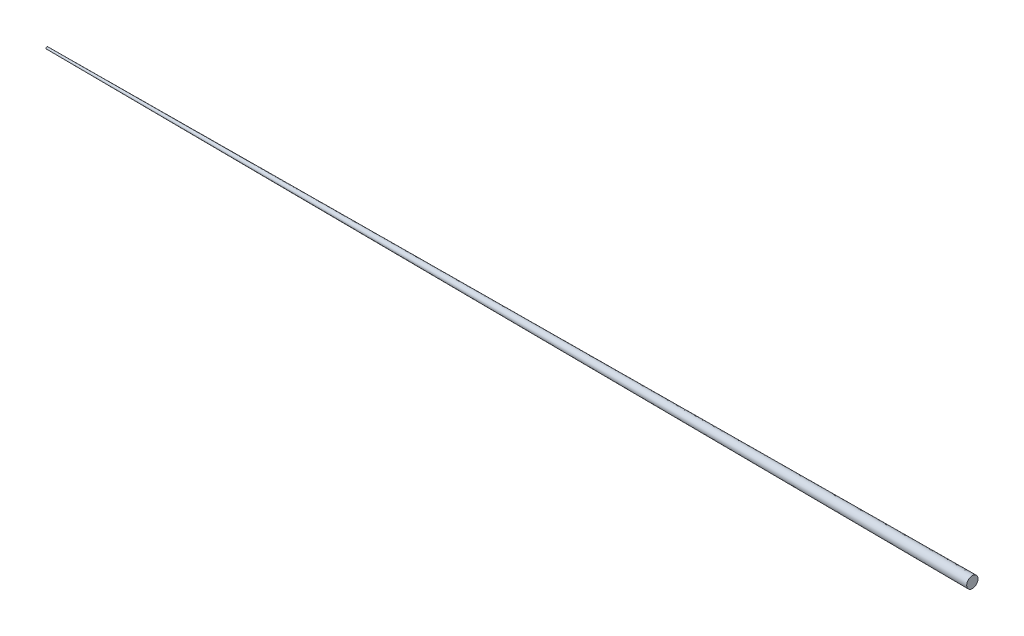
ISO-10303-21;
HEADER;
FILE_DESCRIPTION(('STEP AP214'),'2;1');
FILE_NAME('part.step','',(''),(''),'','','');
FILE_SCHEMA(('AUTOMOTIVE_DESIGN { 1 0 10303 214 1 1 1 1 }'));
ENDSEC;
DATA;
#1=APPLICATION_CONTEXT('core data for automotive mechanical design processes');
#2=APPLICATION_PROTOCOL_DEFINITION('international standard','automotive_design',2000,#1);
#3=PRODUCT_CONTEXT('',#1,'mechanical');
#4=PRODUCT('Part','Part','',(#3));
#5=PRODUCT_RELATED_PRODUCT_CATEGORY('part','',(#4));
#6=PRODUCT_DEFINITION_FORMATION('','',#4);
#7=PRODUCT_DEFINITION_CONTEXT('part definition',#1,'design');
#8=PRODUCT_DEFINITION('design','',#6,#7);
#9=PRODUCT_DEFINITION_SHAPE('','',#8);
#10=(LENGTH_UNIT() NAMED_UNIT(*) SI_UNIT(.MILLI.,.METRE.));
#11=(NAMED_UNIT(*) PLANE_ANGLE_UNIT() SI_UNIT($,.RADIAN.));
#12=(NAMED_UNIT(*) SI_UNIT($,.STERADIAN.) SOLID_ANGLE_UNIT());
#13=UNCERTAINTY_MEASURE_WITH_UNIT(LENGTH_MEASURE(1.E-05),#10,'distance_accuracy_value','');
#14=(GEOMETRIC_REPRESENTATION_CONTEXT(3) GLOBAL_UNCERTAINTY_ASSIGNED_CONTEXT((#13)) GLOBAL_UNIT_ASSIGNED_CONTEXT((#10,
#11,#12)) REPRESENTATION_CONTEXT('',''));
#15=CARTESIAN_POINT('',(0.,0.,0.));
#16=DIRECTION('',(0.,0.,1.));
#17=DIRECTION('',(1.,0.,0.));
#18=AXIS2_PLACEMENT_3D('',#15,#16,#17);
#19=CARTESIAN_POINT('',(100.,0.,0.));
#20=DIRECTION('',(1.,0.,0.));
#21=DIRECTION('',(0.,0.,-1.));
#22=AXIS2_PLACEMENT_3D('',#19,#20,#21);
#23=PLANE('',#22);
#24=CARTESIAN_POINT('',(100.,0.,0.));
#25=DIRECTION('',(1.,0.,0.));
#26=DIRECTION('',(0.,0.,-1.));
#27=AXIS2_PLACEMENT_3D('',#24,#25,#26);
#28=CIRCLE('',#27,1.85);
#29=CARTESIAN_POINT('',(100.,0.,-1.85));
#30=VERTEX_POINT('',#29);
#31=EDGE_CURVE('E5',#30,#30,#28,.T.);
#32=ORIENTED_EDGE('',*,*,#31,.F.);
#33=EDGE_LOOP('',(#32));
#34=FACE_BOUND('',#33,.T.);
#35=ADVANCED_FACE('F9',(#34),#23,.F.);
#36=CARTESIAN_POINT('',(100.,0.,0.));
#37=DIRECTION('',(1.,0.,0.));
#38=DIRECTION('',(0.,0.,-1.));
#39=AXIS2_PLACEMENT_3D('',#36,#37,#38);
#40=CONICAL_SURFACE('',#39,1.85,0.00508328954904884);
#41=CARTESIAN_POINT('',(1900.,0.,0.));
#42=DIRECTION('',(1.,0.,0.));
#43=DIRECTION('',(0.,0.,-1.));
#44=AXIS2_PLACEMENT_3D('',#41,#42,#43);
#45=CIRCLE('',#44,10.9999999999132);
#46=CARTESIAN_POINT('',(1900.,0.,-10.9999999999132));
#47=VERTEX_POINT('',#46);
#48=EDGE_CURVE('E20',#47,#47,#45,.T.);
#49=CARTESIAN_POINT('',(1900.,0.,-10.9999999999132));
#50=CARTESIAN_POINT('',(1881.25,0.,-10.9046874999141));
#51=CARTESIAN_POINT('',(1862.5,0.,-10.809374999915));
#52=CARTESIAN_POINT('',(1825.,0.,-10.6187499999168));
#53=CARTESIAN_POINT('',(1806.25,0.,-10.5234374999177));
#54=CARTESIAN_POINT('',(1768.75,0.,-10.3328124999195));
#55=CARTESIAN_POINT('',(1750.,0.,-10.2374999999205));
#56=CARTESIAN_POINT('',(1712.5,0.,-10.0468749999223));
#57=CARTESIAN_POINT('',(1693.75,0.,-9.95156249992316));
#58=CARTESIAN_POINT('',(1656.25,0.,-9.76093749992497));
#59=CARTESIAN_POINT('',(1637.5,0.,-9.66562499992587));
#60=CARTESIAN_POINT('',(1600.,0.,-9.47499999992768));
#61=CARTESIAN_POINT('',(1581.25,0.,-9.37968749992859));
#62=CARTESIAN_POINT('',(1543.75,0.,-9.18906249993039));
#63=CARTESIAN_POINT('',(1525.,0.,-9.0937499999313));
#64=CARTESIAN_POINT('',(1487.5,0.,-8.90312499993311));
#65=CARTESIAN_POINT('',(1468.75,0.,-8.80781249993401));
#66=CARTESIAN_POINT('',(1431.25,0.,-8.61718749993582));
#67=CARTESIAN_POINT('',(1412.5,0.,-8.52187499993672));
#68=CARTESIAN_POINT('',(1375.,0.,-8.33124999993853));
#69=CARTESIAN_POINT('',(1356.25,0.,-8.23593749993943));
#70=CARTESIAN_POINT('',(1318.75,0.,-8.04531249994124));
#71=CARTESIAN_POINT('',(1300.,0.,-7.94999999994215));
#72=CARTESIAN_POINT('',(1262.5,0.,-7.75937499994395));
#73=CARTESIAN_POINT('',(1243.75,0.,-7.66406249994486));
#74=CARTESIAN_POINT('',(1206.25,0.,-7.47343749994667));
#75=CARTESIAN_POINT('',(1187.5,0.,-7.37812499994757));
#76=CARTESIAN_POINT('',(1150.,0.,-7.18749999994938));
#77=CARTESIAN_POINT('',(1131.25,0.,-7.09218749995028));
#78=CARTESIAN_POINT('',(1093.75,0.,-6.90156249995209));
#79=CARTESIAN_POINT('',(1075.,0.,-6.80624999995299));
#80=CARTESIAN_POINT('',(1037.5,0.,-6.6156249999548));
#81=CARTESIAN_POINT('',(1018.75,0.,-6.5203124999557));
#82=CARTESIAN_POINT('',(981.25,0.,-6.32968749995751));
#83=CARTESIAN_POINT('',(962.5,0.,-6.23437499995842));
#84=CARTESIAN_POINT('',(925.,0.,-6.04374999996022));
#85=CARTESIAN_POINT('',(906.25,0.,-5.94843749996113));
#86=CARTESIAN_POINT('',(868.75,0.,-5.75781249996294));
#87=CARTESIAN_POINT('',(850.,0.,-5.66249999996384));
#88=CARTESIAN_POINT('',(812.5,0.,-5.47187499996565));
#89=CARTESIAN_POINT('',(793.75,0.,-5.37656249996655));
#90=CARTESIAN_POINT('',(756.25,0.,-5.18593749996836));
#91=CARTESIAN_POINT('',(737.5,0.,-5.09062499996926));
#92=CARTESIAN_POINT('',(700.,0.,-4.89999999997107));
#93=CARTESIAN_POINT('',(681.25,0.,-4.80468749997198));
#94=CARTESIAN_POINT('',(643.75,0.,-4.61406249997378));
#95=CARTESIAN_POINT('',(625.,0.,-4.51874999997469));
#96=CARTESIAN_POINT('',(587.5,0.,-4.3281249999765));
#97=CARTESIAN_POINT('',(568.75,0.,-4.2328124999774));
#98=CARTESIAN_POINT('',(531.25,0.,-4.04218749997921));
#99=CARTESIAN_POINT('',(512.5,0.,-3.94687499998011));
#100=CARTESIAN_POINT('',(475.,0.,-3.75624999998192));
#101=CARTESIAN_POINT('',(456.25,0.,-3.66093749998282));
#102=CARTESIAN_POINT('',(418.75,0.,-3.47031249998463));
#103=CARTESIAN_POINT('',(400.,0.,-3.37499999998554));
#104=CARTESIAN_POINT('',(362.5,0.,-3.18437499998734));
#105=CARTESIAN_POINT('',(343.75,0.,-3.08906249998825));
#106=CARTESIAN_POINT('',(306.25,0.,-2.89843749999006));
#107=CARTESIAN_POINT('',(287.5,0.,-2.80312499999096));
#108=CARTESIAN_POINT('',(250.,0.,-2.61249999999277));
#109=CARTESIAN_POINT('',(231.25,0.,-2.51718749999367));
#110=CARTESIAN_POINT('',(193.75,0.,-2.32656249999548));
#111=CARTESIAN_POINT('',(175.,0.,-2.23124999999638));
#112=CARTESIAN_POINT('',(137.5,0.,-2.04062499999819));
#113=CARTESIAN_POINT('',(118.75,0.,-1.9453124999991));
#114=CARTESIAN_POINT('',(100.,0.,-1.85));
#115=B_SPLINE_CURVE_WITH_KNOTS('',3,(#49,#50,#51,#52,#53,#54,#55,#56,#57,#58,#59,#60,#61,#62,
#63,#64,#65,#66,#67,#68,#69,#70,#71,#72,#73,#74,#75,#76,#77,#78,#79,#80,#81,#82,#83,#84,#85,#86,
#87,#88,#89,#90,#91,#92,#93,#94,#95,#96,#97,#98,#99,#100,#101,#102,#103,#104,#105,#106,#107,
#108,#109,#110,#111,#112,#113,#114),.UNSPECIFIED.,.F.,.F.,(4,2,2,2,2,2,2,2,2,2,2,2,2,2,2,2,2,2,
2,2,2,2,2,2,2,2,2,2,2,2,2,2,4),(0.,56.2507267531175,112.501453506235,168.752180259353,
225.002907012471,281.253633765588,337.504360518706,393.755087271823,450.005814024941,
506.256540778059,562.507267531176,618.757994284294,675.008721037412,731.259447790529,
787.510174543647,843.760901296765,900.011628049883,956.262354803,1012.51308155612,
1068.76380830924,1125.01453506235,1181.26526181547,1237.51598856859,1293.76671532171,
1350.01744207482,1406.26816882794,1462.51889558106,1518.76962233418,1575.02034908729,
1631.27107584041,1687.52180259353,1743.77252934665,1800.02325609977),.UNSPECIFIED.);
#116=EDGE_CURVE('BSEAM26',#47,#30,#115,.T.);
#117=ORIENTED_EDGE('',*,*,#48,.F.);
#118=ORIENTED_EDGE('',*,*,#31,.T.);
#119=ORIENTED_EDGE('',*,*,#116,.T.);
#120=ORIENTED_EDGE('',*,*,#116,.F.);
#121=EDGE_LOOP('',(#117,#119,#118,#120));
#122=FACE_BOUND('',#121,.T.);
#123=ADVANCED_FACE('F26',(#122),#40,.T.);
#124=CARTESIAN_POINT('',(1900.,11.,0.));
#125=DIRECTION('',(-1.,0.,0.));
#126=DIRECTION('',(0.,0.,1.));
#127=AXIS2_PLACEMENT_3D('',#124,#125,#126);
#128=PLANE('',#127);
#129=ORIENTED_EDGE('',*,*,#48,.T.);
#130=EDGE_LOOP('',(#129));
#131=FACE_BOUND('',#130,.T.);
#132=ADVANCED_FACE('F35',(#131),#128,.F.);
#133=CLOSED_SHELL('',(#35,#123,#132));
#134=MANIFOLD_SOLID_BREP('B1',#133);
#135=ADVANCED_BREP_SHAPE_REPRESENTATION('',(#18,#134),#14);
#136=SHAPE_DEFINITION_REPRESENTATION(#9,#135);
ENDSEC;
END-ISO-10303-21;
